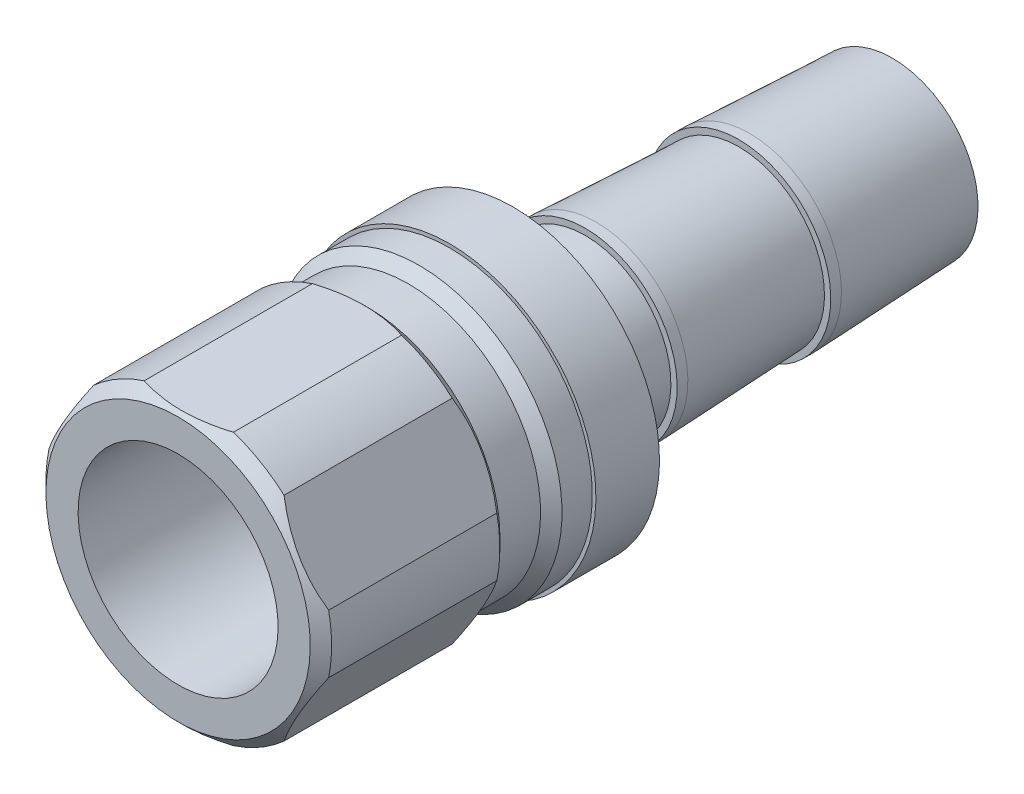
from build123d import *

# Parameters (mm, degrees)
SKETCH2_OUTSIDE_W  = 34.572
SKETCH2_OUTSIDE_H  = 34.572
CUT_EXTRUDE1_DEPTH = 15.875


with BuildPart() as part:
    # Sketch1 → Revolve1 (revolve)
    with BuildSketch(Plane(origin=(0, 0, 0), x_dir=(0, 0, -1), z_dir=(1, 0, 0))):
        Polygon((-19.304, 7.112), (-19.304, 9.398), (-18.542, 10.16), (-6.5786, 10.16), (-5.8166, 9.398), (-2.921, 9.398), (-2.159, 10.16), (0, 10.16), (0, 10.414), (4.5212, 10.414), (4.5212, 6.5405), (7.366, 6.096), (9.652, 6.096), (9.652, 6.5405), (10.414, 6.5405), (20.574, 6.096), (20.574, 6.5405), (21.336, 6.5405), (31.496, 6.096), (31.496, 5.159375), (-3.660770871, 5.159375), (-4.699, 7.112), align=None)
    revolve(axis=Axis((0, 0, 0), (0, 0, 1)))

    # Sketch2 outside → Cut-Extrude1 (cut)
    with BuildSketch(Plane.XY.offset(19.304)):
        Rectangle(SKETCH2_OUTSIDE_W, SKETCH2_OUTSIDE_H)
        Polygon((5.572584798, 9.652), (-5.572584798, 9.652), (-11.145169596, 0), (-5.572584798, -9.652), (5.572584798, -9.652), (11.145169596, 0), align=None, mode=Mode.SUBTRACT)
    extrude(amount=-CUT_EXTRUDE1_DEPTH, mode=Mode.SUBTRACT)


solid = part.part
